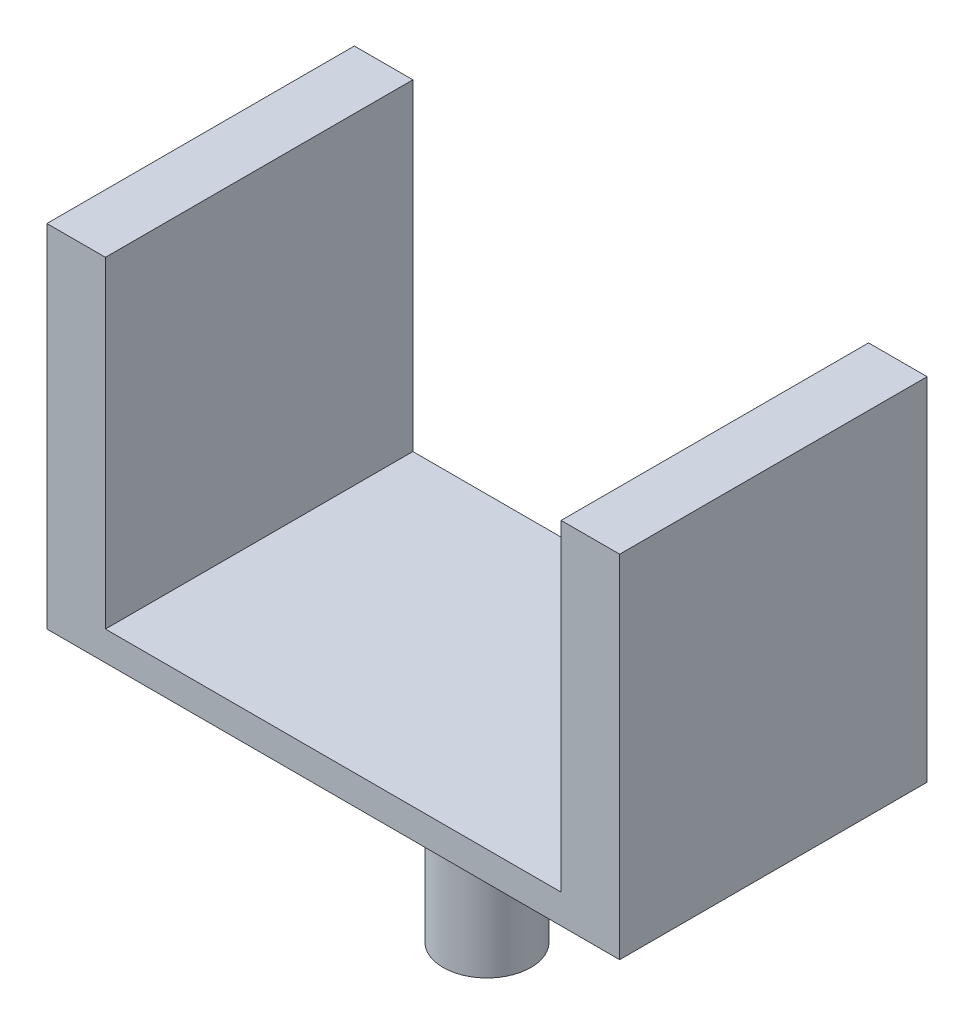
ISO-10303-21;
HEADER;
FILE_DESCRIPTION(('STEP AP214'),'2;1');
FILE_NAME('part.step','',(''),(''),'','','');
FILE_SCHEMA(('AUTOMOTIVE_DESIGN { 1 0 10303 214 1 1 1 1 }'));
ENDSEC;
DATA;
#1=APPLICATION_CONTEXT('core data for automotive mechanical design processes');
#2=APPLICATION_PROTOCOL_DEFINITION('international standard','automotive_design',2000,#1);
#3=PRODUCT_CONTEXT('',#1,'mechanical');
#4=PRODUCT('Part','Part','',(#3));
#5=PRODUCT_RELATED_PRODUCT_CATEGORY('part','',(#4));
#6=PRODUCT_DEFINITION_FORMATION('','',#4);
#7=PRODUCT_DEFINITION_CONTEXT('part definition',#1,'design');
#8=PRODUCT_DEFINITION('design','',#6,#7);
#9=PRODUCT_DEFINITION_SHAPE('','',#8);
#10=(LENGTH_UNIT() NAMED_UNIT(*) SI_UNIT(.MILLI.,.METRE.));
#11=(NAMED_UNIT(*) PLANE_ANGLE_UNIT() SI_UNIT($,.RADIAN.));
#12=(NAMED_UNIT(*) SI_UNIT($,.STERADIAN.) SOLID_ANGLE_UNIT());
#13=UNCERTAINTY_MEASURE_WITH_UNIT(LENGTH_MEASURE(1.E-05),#10,'distance_accuracy_value','');
#14=(GEOMETRIC_REPRESENTATION_CONTEXT(3) GLOBAL_UNCERTAINTY_ASSIGNED_CONTEXT((#13)) GLOBAL_UNIT_ASSIGNED_CONTEXT((#10,
#11,#12)) REPRESENTATION_CONTEXT('',''));
#15=CARTESIAN_POINT('',(0.,0.,0.));
#16=DIRECTION('',(0.,0.,1.));
#17=DIRECTION('',(1.,0.,0.));
#18=AXIS2_PLACEMENT_3D('',#15,#16,#17);
#19=CARTESIAN_POINT('',(0.,24.,0.));
#20=DIRECTION('',(0.,1.,0.));
#21=DIRECTION('',(0.,0.,1.));
#22=AXIS2_PLACEMENT_3D('',#19,#20,#21);
#23=PLANE('',#22);
#24=DIRECTION('',(0.,0.,-1.));
#25=VECTOR('',#24,1.);
#26=CARTESIAN_POINT('',(15.57,24.,0.));
#27=LINE('',#26,#25);
#28=CARTESIAN_POINT('',(15.57,24.,10.505));
#29=VERTEX_POINT('',#28);
#30=CARTESIAN_POINT('',(15.57,24.,-10.505));
#31=VERTEX_POINT('',#30);
#32=EDGE_CURVE('E49',#29,#31,#27,.T.);
#33=ORIENTED_EDGE('',*,*,#32,.F.);
#34=DIRECTION('',(1.,0.,0.));
#35=VECTOR('',#34,1.);
#36=CARTESIAN_POINT('',(19.57,24.,10.505));
#37=LINE('',#36,#35);
#38=CARTESIAN_POINT('',(19.57,24.,10.505));
#39=VERTEX_POINT('',#38);
#40=EDGE_CURVE('E136',#29,#39,#37,.T.);
#41=ORIENTED_EDGE('',*,*,#40,.T.);
#42=DIRECTION('',(0.,0.,-1.));
#43=VECTOR('',#42,1.);
#44=CARTESIAN_POINT('',(19.57,24.,10.505));
#45=LINE('',#44,#43);
#46=CARTESIAN_POINT('',(19.57,24.,-10.505));
#47=VERTEX_POINT('',#46);
#48=EDGE_CURVE('E135',#39,#47,#45,.T.);
#49=ORIENTED_EDGE('',*,*,#48,.T.);
#50=DIRECTION('',(-1.,0.,0.));
#51=VECTOR('',#50,1.);
#52=CARTESIAN_POINT('',(19.57,24.,-10.505));
#53=LINE('',#52,#51);
#54=EDGE_CURVE('E144',#47,#31,#53,.T.);
#55=ORIENTED_EDGE('',*,*,#54,.T.);
#56=EDGE_LOOP('',(#33,#41,#49,#55));
#57=FACE_BOUND('',#56,.T.);
#58=ADVANCED_FACE('F40',(#57),#23,.T.);
#59=CARTESIAN_POINT('',(-19.57,24.,10.505));
#60=DIRECTION('',(1.,0.,0.));
#61=DIRECTION('',(0.,0.,-1.));
#62=AXIS2_PLACEMENT_3D('',#59,#60,#61);
#63=PLANE('',#62);
#64=DIRECTION('',(0.,0.,1.));
#65=VECTOR('',#64,1.);
#66=CARTESIAN_POINT('',(-19.57,0.,10.505));
#67=LINE('',#66,#65);
#68=CARTESIAN_POINT('',(-19.57,0.,-10.505));
#69=VERTEX_POINT('',#68);
#70=CARTESIAN_POINT('',(-19.57,0.,10.505));
#71=VERTEX_POINT('',#70);
#72=EDGE_CURVE('E149',#69,#71,#67,.T.);
#73=ORIENTED_EDGE('',*,*,#72,.T.);
#74=DIRECTION('',(0.,-1.,0.));
#75=VECTOR('',#74,1.);
#76=CARTESIAN_POINT('',(-19.57,24.,10.505));
#77=LINE('',#76,#75);
#78=CARTESIAN_POINT('',(-19.57,24.,10.505));
#79=VERTEX_POINT('',#78);
#80=EDGE_CURVE('E120',#79,#71,#77,.T.);
#81=ORIENTED_EDGE('',*,*,#80,.F.);
#82=DIRECTION('',(0.,0.,1.));
#83=VECTOR('',#82,1.);
#84=CARTESIAN_POINT('',(-19.57,24.,10.505));
#85=LINE('',#84,#83);
#86=CARTESIAN_POINT('',(-19.57,24.,-10.505));
#87=VERTEX_POINT('',#86);
#88=EDGE_CURVE('E132',#87,#79,#85,.T.);
#89=ORIENTED_EDGE('',*,*,#88,.F.);
#90=DIRECTION('',(0.,-1.,0.));
#91=VECTOR('',#90,1.);
#92=CARTESIAN_POINT('',(-19.57,24.,-10.505));
#93=LINE('',#92,#91);
#94=EDGE_CURVE('E148',#87,#69,#93,.T.);
#95=ORIENTED_EDGE('',*,*,#94,.T.);
#96=EDGE_LOOP('',(#73,#81,#89,#95));
#97=FACE_BOUND('',#96,.T.);
#98=ADVANCED_FACE('F42',(#97),#63,.F.);
#99=CARTESIAN_POINT('',(19.57,24.,10.505));
#100=DIRECTION('',(0.,0.,-1.));
#101=DIRECTION('',(-1.,0.,0.));
#102=AXIS2_PLACEMENT_3D('',#99,#100,#101);
#103=PLANE('',#102);
#104=ORIENTED_EDGE('',*,*,#40,.F.);
#105=DIRECTION('',(0.,-1.,0.));
#106=VECTOR('',#105,1.);
#107=CARTESIAN_POINT('',(15.57,24.,10.505));
#108=LINE('',#107,#106);
#109=CARTESIAN_POINT('',(15.57,2.,10.505));
#110=VERTEX_POINT('',#109);
#111=EDGE_CURVE('E178',#29,#110,#108,.T.);
#112=ORIENTED_EDGE('',*,*,#111,.T.);
#113=DIRECTION('',(-1.,0.,0.));
#114=VECTOR('',#113,1.);
#115=CARTESIAN_POINT('',(19.57,2.,10.505));
#116=LINE('',#115,#114);
#117=CARTESIAN_POINT('',(-15.57,2.,10.505));
#118=VERTEX_POINT('',#117);
#119=EDGE_CURVE('E126',#110,#118,#116,.T.);
#120=ORIENTED_EDGE('',*,*,#119,.T.);
#121=DIRECTION('',(0.,1.,0.));
#122=VECTOR('',#121,1.);
#123=CARTESIAN_POINT('',(-15.57,24.,10.505));
#124=LINE('',#123,#122);
#125=CARTESIAN_POINT('',(-15.57,24.,10.505));
#126=VERTEX_POINT('',#125);
#127=EDGE_CURVE('E117',#118,#126,#124,.T.);
#128=ORIENTED_EDGE('',*,*,#127,.T.);
#129=EDGE_CURVE('E94',#79,#126,#37,.T.);
#130=ORIENTED_EDGE('',*,*,#129,.F.);
#131=ORIENTED_EDGE('',*,*,#80,.T.);
#132=DIRECTION('',(1.,0.,0.));
#133=VECTOR('',#132,1.);
#134=CARTESIAN_POINT('',(19.57,0.,10.505));
#135=LINE('',#134,#133);
#136=CARTESIAN_POINT('',(19.57,0.,10.505));
#137=VERTEX_POINT('',#136);
#138=EDGE_CURVE('E153',#71,#137,#135,.T.);
#139=ORIENTED_EDGE('',*,*,#138,.T.);
#140=DIRECTION('',(0.,-1.,0.));
#141=VECTOR('',#140,1.);
#142=CARTESIAN_POINT('',(19.57,24.,10.505));
#143=LINE('',#142,#141);
#144=EDGE_CURVE('E166',#39,#137,#143,.T.);
#145=ORIENTED_EDGE('',*,*,#144,.F.);
#146=EDGE_LOOP('',(#104,#112,#120,#128,#130,#131,#139,#145));
#147=FACE_BOUND('',#146,.T.);
#148=ADVANCED_FACE('F124',(#147),#103,.F.);
#149=CARTESIAN_POINT('',(19.57,24.,10.505));
#150=DIRECTION('',(-1.,0.,0.));
#151=DIRECTION('',(0.,0.,1.));
#152=AXIS2_PLACEMENT_3D('',#149,#150,#151);
#153=PLANE('',#152);
#154=DIRECTION('',(0.,0.,-1.));
#155=VECTOR('',#154,1.);
#156=CARTESIAN_POINT('',(19.57,0.,10.505));
#157=LINE('',#156,#155);
#158=CARTESIAN_POINT('',(19.57,0.,-10.505));
#159=VERTEX_POINT('',#158);
#160=EDGE_CURVE('E156',#137,#159,#157,.T.);
#161=ORIENTED_EDGE('',*,*,#160,.T.);
#162=DIRECTION('',(0.,-1.,0.));
#163=VECTOR('',#162,1.);
#164=CARTESIAN_POINT('',(19.57,24.,-10.505));
#165=LINE('',#164,#163);
#166=EDGE_CURVE('E163',#47,#159,#165,.T.);
#167=ORIENTED_EDGE('',*,*,#166,.F.);
#168=ORIENTED_EDGE('',*,*,#48,.F.);
#169=ORIENTED_EDGE('',*,*,#144,.T.);
#170=EDGE_LOOP('',(#161,#167,#168,#169));
#171=FACE_BOUND('',#170,.T.);
#172=ADVANCED_FACE('F188',(#171),#153,.F.);
#173=CARTESIAN_POINT('',(19.57,24.,-10.505));
#174=DIRECTION('',(0.,0.,1.));
#175=DIRECTION('',(1.,0.,0.));
#176=AXIS2_PLACEMENT_3D('',#173,#174,#175);
#177=PLANE('',#176);
#178=DIRECTION('',(1.,0.,0.));
#179=VECTOR('',#178,1.);
#180=CARTESIAN_POINT('',(19.57,2.,-10.505));
#181=LINE('',#180,#179);
#182=CARTESIAN_POINT('',(-15.57,2.,-10.505));
#183=VERTEX_POINT('',#182);
#184=CARTESIAN_POINT('',(15.57,2.,-10.505));
#185=VERTEX_POINT('',#184);
#186=EDGE_CURVE('E12',#183,#185,#181,.T.);
#187=ORIENTED_EDGE('',*,*,#186,.T.);
#188=DIRECTION('',(0.,1.,0.));
#189=VECTOR('',#188,1.);
#190=CARTESIAN_POINT('',(15.57,24.,-10.505));
#191=LINE('',#190,#189);
#192=EDGE_CURVE('E128',#185,#31,#191,.T.);
#193=ORIENTED_EDGE('',*,*,#192,.T.);
#194=ORIENTED_EDGE('',*,*,#54,.F.);
#195=ORIENTED_EDGE('',*,*,#166,.T.);
#196=DIRECTION('',(-1.,0.,0.));
#197=VECTOR('',#196,1.);
#198=CARTESIAN_POINT('',(19.57,0.,-10.505));
#199=LINE('',#198,#197);
#200=EDGE_CURVE('E86',#159,#69,#199,.T.);
#201=ORIENTED_EDGE('',*,*,#200,.T.);
#202=ORIENTED_EDGE('',*,*,#94,.F.);
#203=CARTESIAN_POINT('',(-15.57,24.,-10.505));
#204=VERTEX_POINT('',#203);
#205=EDGE_CURVE('E64',#204,#87,#53,.T.);
#206=ORIENTED_EDGE('',*,*,#205,.F.);
#207=DIRECTION('',(0.,-1.,0.));
#208=VECTOR('',#207,1.);
#209=CARTESIAN_POINT('',(-15.57,24.,-10.505));
#210=LINE('',#209,#208);
#211=EDGE_CURVE('E56',#204,#183,#210,.T.);
#212=ORIENTED_EDGE('',*,*,#211,.T.);
#213=EDGE_LOOP('',(#187,#193,#194,#195,#201,#202,#206,#212));
#214=FACE_BOUND('',#213,.T.);
#215=ADVANCED_FACE('F181',(#214),#177,.F.);
#216=DIRECTION('',(0.,0.,1.));
#217=VECTOR('',#216,1.);
#218=CARTESIAN_POINT('',(-15.57,24.,0.));
#219=LINE('',#218,#217);
#220=EDGE_CURVE('E115',#204,#126,#219,.T.);
#221=ORIENTED_EDGE('',*,*,#220,.F.);
#222=ORIENTED_EDGE('',*,*,#205,.T.);
#223=ORIENTED_EDGE('',*,*,#88,.T.);
#224=ORIENTED_EDGE('',*,*,#129,.T.);
#225=EDGE_LOOP('',(#221,#222,#223,#224));
#226=FACE_BOUND('',#225,.T.);
#227=ADVANCED_FACE('F130',(#226),#23,.T.);
#228=CARTESIAN_POINT('',(0.,0.,0.));
#229=DIRECTION('',(0.,1.,0.));
#230=DIRECTION('',(0.,0.,1.));
#231=AXIS2_PLACEMENT_3D('',#228,#229,#230);
#232=PLANE('',#231);
#233=CARTESIAN_POINT('',(0.,0.,0.));
#234=DIRECTION('',(0.,1.,0.));
#235=DIRECTION('',(0.,0.,1.));
#236=AXIS2_PLACEMENT_3D('',#233,#234,#235);
#237=CIRCLE('',#236,3.);
#238=CARTESIAN_POINT('',(0.,0.,3.));
#239=VERTEX_POINT('',#238);
#240=EDGE_CURVE('E209',#239,#239,#237,.T.);
#241=ORIENTED_EDGE('',*,*,#240,.T.);
#242=EDGE_LOOP('',(#241));
#243=FACE_BOUND('',#242,.T.);
#244=ORIENTED_EDGE('',*,*,#72,.F.);
#245=ORIENTED_EDGE('',*,*,#200,.F.);
#246=ORIENTED_EDGE('',*,*,#160,.F.);
#247=ORIENTED_EDGE('',*,*,#138,.F.);
#248=EDGE_LOOP('',(#244,#245,#246,#247));
#249=FACE_BOUND('',#248,.T.);
#250=ADVANCED_FACE('F192',(#243,#249),#232,.F.);
#251=CARTESIAN_POINT('',(15.57,2.,24.));
#252=DIRECTION('',(0.,-1.,0.));
#253=DIRECTION('',(1.,0.,0.));
#254=AXIS2_PLACEMENT_3D('',#251,#252,#253);
#255=PLANE('',#254);
#256=DIRECTION('',(0.,0.,-1.));
#257=VECTOR('',#256,1.);
#258=CARTESIAN_POINT('',(15.57,2.,24.));
#259=LINE('',#258,#257);
#260=EDGE_CURVE('E196',#110,#185,#259,.T.);
#261=ORIENTED_EDGE('',*,*,#260,.T.);
#262=ORIENTED_EDGE('',*,*,#186,.F.);
#263=DIRECTION('',(0.,0.,-1.));
#264=VECTOR('',#263,1.);
#265=CARTESIAN_POINT('',(-15.57,2.,24.));
#266=LINE('',#265,#264);
#267=EDGE_CURVE('E199',#118,#183,#266,.T.);
#268=ORIENTED_EDGE('',*,*,#267,.F.);
#269=ORIENTED_EDGE('',*,*,#119,.F.);
#270=EDGE_LOOP('',(#261,#262,#268,#269));
#271=FACE_BOUND('',#270,.T.);
#272=ADVANCED_FACE('F239',(#271),#255,.F.);
#273=CARTESIAN_POINT('',(15.57,24.,24.));
#274=DIRECTION('',(1.,0.,0.));
#275=DIRECTION('',(0.,1.,0.));
#276=AXIS2_PLACEMENT_3D('',#273,#274,#275);
#277=PLANE('',#276);
#278=ORIENTED_EDGE('',*,*,#32,.T.);
#279=ORIENTED_EDGE('',*,*,#192,.F.);
#280=ORIENTED_EDGE('',*,*,#260,.F.);
#281=ORIENTED_EDGE('',*,*,#111,.F.);
#282=EDGE_LOOP('',(#278,#279,#280,#281));
#283=FACE_BOUND('',#282,.T.);
#284=ADVANCED_FACE('F175',(#283),#277,.F.);
#285=CARTESIAN_POINT('',(-15.57,2.,24.));
#286=DIRECTION('',(-1.,0.,0.));
#287=DIRECTION('',(0.,0.,1.));
#288=AXIS2_PLACEMENT_3D('',#285,#286,#287);
#289=PLANE('',#288);
#290=ORIENTED_EDGE('',*,*,#267,.T.);
#291=ORIENTED_EDGE('',*,*,#211,.F.);
#292=ORIENTED_EDGE('',*,*,#220,.T.);
#293=ORIENTED_EDGE('',*,*,#127,.F.);
#294=EDGE_LOOP('',(#290,#291,#292,#293));
#295=FACE_BOUND('',#294,.T.);
#296=ADVANCED_FACE('F116',(#295),#289,.F.);
#297=CARTESIAN_POINT('',(0.,-14.,0.));
#298=DIRECTION('',(0.,1.,0.));
#299=DIRECTION('',(0.,0.,1.));
#300=AXIS2_PLACEMENT_3D('',#297,#298,#299);
#301=CYLINDRICAL_SURFACE('',#300,3.);
#302=CARTESIAN_POINT('',(0.,-14.,0.));
#303=DIRECTION('',(0.,1.,0.));
#304=DIRECTION('',(0.,0.,1.));
#305=AXIS2_PLACEMENT_3D('',#302,#303,#304);
#306=CIRCLE('',#305,3.);
#307=CARTESIAN_POINT('',(0.,-14.,3.));
#308=VERTEX_POINT('',#307);
#309=EDGE_CURVE('E208',#308,#308,#306,.T.);
#310=ORIENTED_EDGE('',*,*,#309,.T.);
#311=EDGE_LOOP('',(#310));
#312=FACE_BOUND('',#311,.T.);
#313=ORIENTED_EDGE('',*,*,#240,.F.);
#314=EDGE_LOOP('',(#313));
#315=FACE_BOUND('',#314,.T.);
#316=ADVANCED_FACE('F217',(#312,#315),#301,.T.);
#317=CARTESIAN_POINT('',(0.,-14.,0.));
#318=DIRECTION('',(0.,1.,0.));
#319=DIRECTION('',(0.,0.,1.));
#320=AXIS2_PLACEMENT_3D('',#317,#318,#319);
#321=PLANE('',#320);
#322=ORIENTED_EDGE('',*,*,#309,.F.);
#323=EDGE_LOOP('',(#322));
#324=FACE_BOUND('',#323,.T.);
#325=ADVANCED_FACE('F220',(#324),#321,.F.);
#326=CLOSED_SHELL('',(#58,#98,#148,#172,#215,#227,#250,#272,#284,#296,#316,#325));
#327=MANIFOLD_SOLID_BREP('B2',#326);
#328=ADVANCED_BREP_SHAPE_REPRESENTATION('',(#18,#327),#14);
#329=SHAPE_DEFINITION_REPRESENTATION(#9,#328);
ENDSEC;
END-ISO-10303-21;
